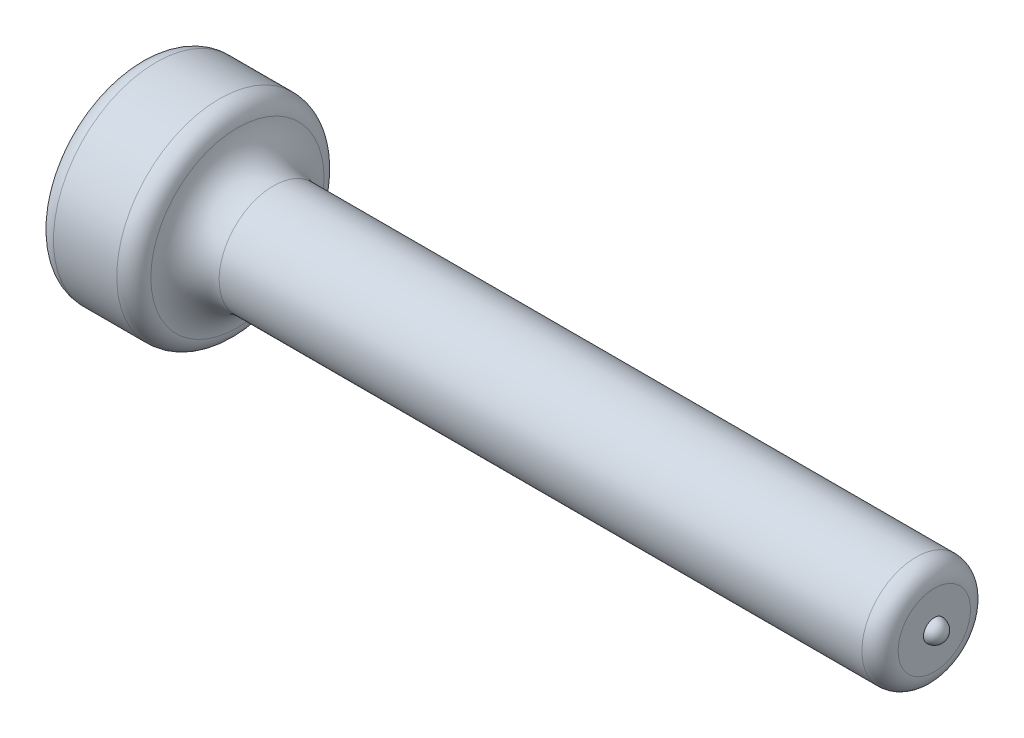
from build123d import *

# Parameters (mm, degrees)
FILLET1_R = 2
FILLET2_R = 1
FILLET3_R = 1
SKETCH3_W = 1.096
SKETCH3_H = 3.783333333


with BuildPart() as part:
    # Sketch1 → Base-Revolve (revolve)
    with BuildSketch(Plane(origin=(26.604642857, 20.929642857, 0), x_dir=(0, 1, 0), z_dir=(0, 0, 1)), mode=Mode.PRIVATE) as base_revolve_sk:
        Polygon((-20.929642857, -17.395357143), (-17.929642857, -17.395357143), (-17.929642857, 21.124642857), (-15.254642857, 21.124642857), (-15.254642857, 26.604642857), (-20.929642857, 26.604642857), align=None)
    revolve(base_revolve_sk.sketch.rotate(Axis((-36.5325, 0, 0), (1, 0, 0)), 180), axis=Axis((-36.5325, 0, 0), (1, 0, 0)))

    # Fillet1
    fillet1_edges = [part.edges().sort_by_distance(p)[0] for p in [
        (5.48, 3, 0),
    ]]
    fillet(fillet1_edges, radius=FILLET1_R)

    # Fillet2
    fillet2_edges = [part.edges().sort_by_distance(p)[0] for p in [
        (44, 3, 0),
    ]]
    fillet(fillet2_edges, radius=FILLET2_R)

    # Fillet3
    fillet3_edges = [part.edges().sort_by_distance(p)[0] for p in [
        (5.48, 5.675, 0),
        (0, 5.675, 0),
    ]]
    fillet(fillet3_edges, radius=FILLET3_R)

    # Sketch2 → Revolve1 (revolve)
    with BuildSketch(Plane.XY):
        with BuildLine():
            Line((43.4, 0), (44.6, 0))
            ThreePointArc((44.6, 0), (44, 0.6), (43.4, 0))
        make_face()
    revolve(axis=Axis((0, 0, 0), (1, 0, 0)))

    # Sketch3 → Cut-Revolve1 (revolve, cut)
    with BuildSketch(Plane.XY):
        with Locations((0.548, 1.891666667)):
            Rectangle(SKETCH3_W, SKETCH3_H)
    revolve(axis=Axis((0, 0, 0), (-1, 0, 0)), mode=Mode.SUBTRACT)


solid = part.part
